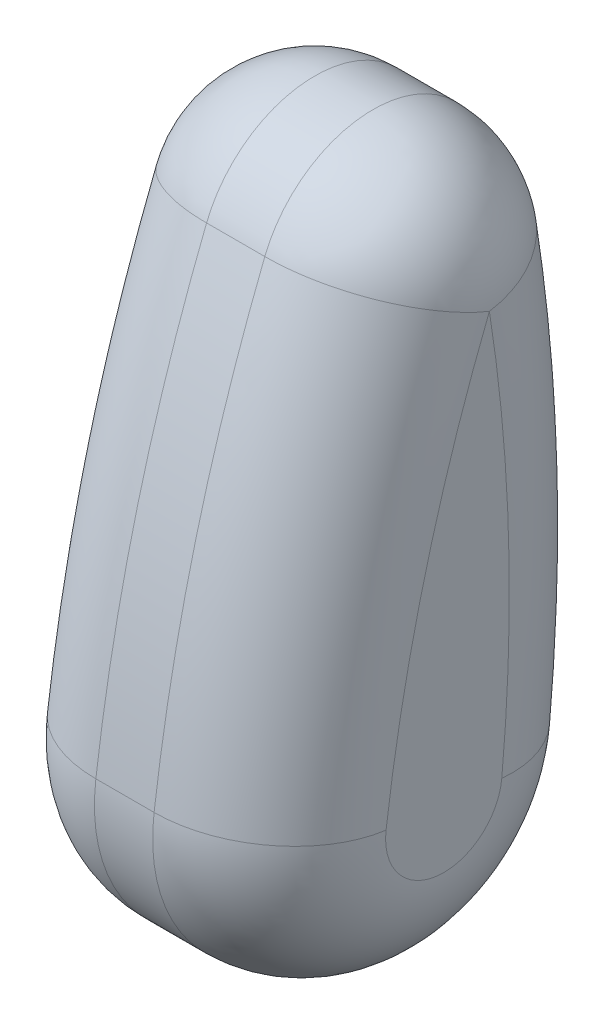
from build123d import *

# Parameters (mm, degrees)
BASE_EXTRUDE_DEPTH = 63.5
FILLET1_R          = 50.8


with BuildPart() as part:
    # Sketch8 → Base-Extrude (new, symmetric)
    with BuildSketch(Plane(origin=(0, 0, 0), x_dir=(0, 0, -1), z_dir=(1, 0, 0))):
        with BuildLine():
            ThreePointArc((-69.637611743, 202.48222577), (-2.581676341, 117.03801616), (81.787388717, 185.441760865))
            ThreePointArc((81.787388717, 185.441760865), (84.963831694, 281.584095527), (76.002168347, 377.360537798))
            ThreePointArc((76.002168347, 377.360537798), (31.50354767, 419.926176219), (-21.342474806, 388.31512238))
            ThreePointArc((-21.342474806, 388.31512238), (-51.366642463, 296.925912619), (-69.637611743, 202.48222577))
        make_face()
    extrude(amount=BASE_EXTRUDE_DEPTH, both=True)

    # Fillet1
    fillet1_edges = [part.edges().sort_by_distance(p)[0] for p in [
        (63.5, 281.584095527, -84.963831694),
        (63.5, 419.926176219, -31.50354767),
        (63.5, 296.925912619, 51.366642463),
        (-63.5, 419.926176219, -31.50354767),
        (-63.5, 281.584095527, -84.963831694),
        (-63.5, 117.03801616, 2.581676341),
        (-63.5, 296.925912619, 51.366642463),
        (63.5, 117.03801616, 2.581676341),
    ]]
    fillet(fillet1_edges, radius=FILLET1_R)


solid = part.part
